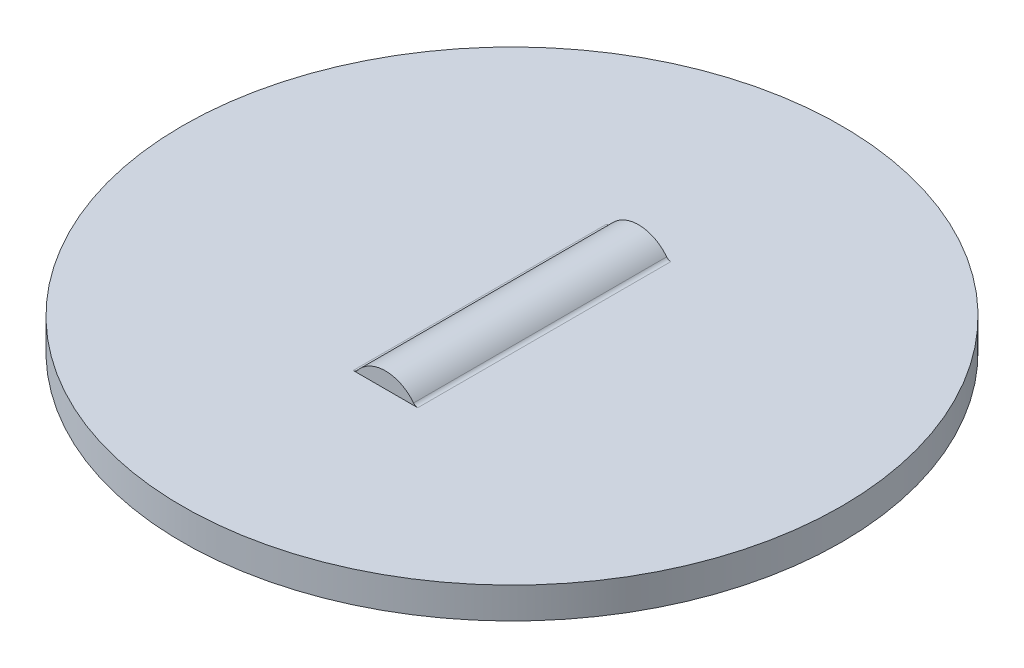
ISO-10303-21;
HEADER;
FILE_DESCRIPTION(('STEP AP214'),'2;1');
FILE_NAME('part.step','',(''),(''),'','','');
FILE_SCHEMA(('AUTOMOTIVE_DESIGN { 1 0 10303 214 1 1 1 1 }'));
ENDSEC;
DATA;
#1=APPLICATION_CONTEXT('core data for automotive mechanical design processes');
#2=APPLICATION_PROTOCOL_DEFINITION('international standard','automotive_design',2000,#1);
#3=PRODUCT_CONTEXT('',#1,'mechanical');
#4=PRODUCT('Part','Part','',(#3));
#5=PRODUCT_RELATED_PRODUCT_CATEGORY('part','',(#4));
#6=PRODUCT_DEFINITION_FORMATION('','',#4);
#7=PRODUCT_DEFINITION_CONTEXT('part definition',#1,'design');
#8=PRODUCT_DEFINITION('design','',#6,#7);
#9=PRODUCT_DEFINITION_SHAPE('','',#8);
#10=(LENGTH_UNIT() NAMED_UNIT(*) SI_UNIT(.MILLI.,.METRE.));
#11=(NAMED_UNIT(*) PLANE_ANGLE_UNIT() SI_UNIT($,.RADIAN.));
#12=(NAMED_UNIT(*) SI_UNIT($,.STERADIAN.) SOLID_ANGLE_UNIT());
#13=UNCERTAINTY_MEASURE_WITH_UNIT(LENGTH_MEASURE(1.E-05),#10,'distance_accuracy_value','');
#14=(GEOMETRIC_REPRESENTATION_CONTEXT(3) GLOBAL_UNCERTAINTY_ASSIGNED_CONTEXT((#13)) GLOBAL_UNIT_ASSIGNED_CONTEXT((#10,
#11,#12)) REPRESENTATION_CONTEXT('',''));
#15=CARTESIAN_POINT('',(0.,0.,0.));
#16=DIRECTION('',(0.,0.,1.));
#17=DIRECTION('',(1.,0.,0.));
#18=AXIS2_PLACEMENT_3D('',#15,#16,#17);
#19=CARTESIAN_POINT('',(0.,-0.9525,0.));
#20=DIRECTION('',(0.,0.,1.));
#21=DIRECTION('',(1.,0.,0.));
#22=AXIS2_PLACEMENT_3D('',#19,#20,#21);
#23=CYLINDRICAL_SURFACE('',#22,0.2159);
#24=DIRECTION('',(0.,0.,1.));
#25=VECTOR('',#24,1.);
#26=CARTESIAN_POINT('',(-0.170595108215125,-0.820174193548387,0.));
#27=LINE('',#26,#25);
#28=CARTESIAN_POINT('',(-0.170595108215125,-0.820174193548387,0.));
#29=VERTEX_POINT('',#28);
#30=CARTESIAN_POINT('',(-0.170595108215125,-0.820174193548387,12.192));
#31=VERTEX_POINT('',#30);
#32=EDGE_CURVE('E111',#29,#31,#27,.T.);
#33=ORIENTED_EDGE('',*,*,#32,.F.);
#34=CARTESIAN_POINT('',(0.,-0.9525,0.));
#35=DIRECTION('',(0.,0.,1.));
#36=DIRECTION('',(1.,0.,0.));
#37=AXIS2_PLACEMENT_3D('',#34,#35,#36);
#38=CIRCLE('',#37,0.2159);
#39=CARTESIAN_POINT('',(0.170595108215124,-0.820174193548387,0.));
#40=VERTEX_POINT('',#39);
#41=EDGE_CURVE('E114',#40,#29,#38,.T.);
#42=ORIENTED_EDGE('',*,*,#41,.F.);
#43=DIRECTION('',(0.,0.,1.));
#44=VECTOR('',#43,1.);
#45=CARTESIAN_POINT('',(0.170595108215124,-0.820174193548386,0.));
#46=LINE('',#45,#44);
#47=CARTESIAN_POINT('',(0.170595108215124,-0.820174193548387,12.192));
#48=VERTEX_POINT('',#47);
#49=EDGE_CURVE('E88',#48,#40,#46,.F.);
#50=ORIENTED_EDGE('',*,*,#49,.F.);
#51=CARTESIAN_POINT('',(0.,-0.9525,12.192));
#52=DIRECTION('',(0.,0.,1.));
#53=DIRECTION('',(1.,0.,0.));
#54=AXIS2_PLACEMENT_3D('',#51,#52,#53);
#55=CIRCLE('',#54,0.2159);
#56=EDGE_CURVE('E85',#48,#31,#55,.T.);
#57=ORIENTED_EDGE('',*,*,#56,.T.);
#58=EDGE_LOOP('',(#33,#42,#50,#57));
#59=FACE_BOUND('',#58,.T.);
#60=ADVANCED_FACE('F18',(#59),#23,.F.);
#61=CARTESIAN_POINT('',(1.55542598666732,0.254,0.));
#62=DIRECTION('',(0.,0.,1.));
#63=DIRECTION('',(1.,0.,0.));
#64=AXIS2_PLACEMENT_3D('',#61,#62,#63);
#65=CYLINDRICAL_SURFACE('',#64,1.7526);
#66=CARTESIAN_POINT('',(1.55542598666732,0.254,0.));
#67=DIRECTION('',(0.,0.,1.));
#68=DIRECTION('',(1.,0.,0.));
#69=AXIS2_PLACEMENT_3D('',#66,#67,#68);
#70=CIRCLE('',#69,1.7526);
#71=CARTESIAN_POINT('',(1.55542598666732,-1.4986,0.));
#72=VERTEX_POINT('',#71);
#73=EDGE_CURVE('E101',#72,#40,#70,.F.);
#74=ORIENTED_EDGE('',*,*,#73,.F.);
#75=DIRECTION('',(0.,0.,1.));
#76=VECTOR('',#75,1.);
#77=CARTESIAN_POINT('',(1.55542598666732,-1.4986,12.192));
#78=LINE('',#77,#76);
#79=CARTESIAN_POINT('',(1.55542598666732,-1.4986,12.192));
#80=VERTEX_POINT('',#79);
#81=EDGE_CURVE('E94',#72,#80,#78,.T.);
#82=ORIENTED_EDGE('',*,*,#81,.T.);
#83=CARTESIAN_POINT('',(1.55542598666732,0.254,12.192));
#84=DIRECTION('',(0.,0.,1.));
#85=DIRECTION('',(1.,0.,0.));
#86=AXIS2_PLACEMENT_3D('',#83,#84,#85);
#87=CIRCLE('',#86,1.7526);
#88=EDGE_CURVE('E21',#80,#48,#87,.F.);
#89=ORIENTED_EDGE('',*,*,#88,.T.);
#90=ORIENTED_EDGE('',*,*,#49,.T.);
#91=EDGE_LOOP('',(#74,#82,#89,#90));
#92=FACE_BOUND('',#91,.T.);
#93=ADVANCED_FACE('F99',(#92),#65,.T.);
#94=CARTESIAN_POINT('',(0.,-0.9525,12.192));
#95=DIRECTION('',(0.,0.,1.));
#96=DIRECTION('',(1.,0.,0.));
#97=AXIS2_PLACEMENT_3D('',#94,#95,#96);
#98=PLANE('',#97);
#99=ORIENTED_EDGE('',*,*,#88,.F.);
#100=DIRECTION('',(1.,0.,0.));
#101=VECTOR('',#100,1.);
#102=CARTESIAN_POINT('',(-15.875,-1.4986,12.192));
#103=LINE('',#102,#101);
#104=CARTESIAN_POINT('',(-1.55542598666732,-1.4986,12.192));
#105=VERTEX_POINT('',#104);
#106=EDGE_CURVE('E84',#80,#105,#103,.F.);
#107=ORIENTED_EDGE('',*,*,#106,.T.);
#108=CARTESIAN_POINT('',(-1.55542598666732,0.254,12.192));
#109=DIRECTION('',(0.,0.,1.));
#110=DIRECTION('',(1.,0.,0.));
#111=AXIS2_PLACEMENT_3D('',#108,#109,#110);
#112=CIRCLE('',#111,1.7526);
#113=EDGE_CURVE('E115',#31,#105,#112,.F.);
#114=ORIENTED_EDGE('',*,*,#113,.F.);
#115=ORIENTED_EDGE('',*,*,#56,.F.);
#116=EDGE_LOOP('',(#99,#107,#114,#115));
#117=FACE_BOUND('',#116,.T.);
#118=ADVANCED_FACE('F82',(#117),#98,.F.);
#119=CARTESIAN_POINT('',(-1.55542598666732,0.254,0.));
#120=DIRECTION('',(0.,0.,1.));
#121=DIRECTION('',(1.,0.,0.));
#122=AXIS2_PLACEMENT_3D('',#119,#120,#121);
#123=CYLINDRICAL_SURFACE('',#122,1.7526);
#124=CARTESIAN_POINT('',(-1.55542598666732,0.254,0.));
#125=DIRECTION('',(0.,0.,1.));
#126=DIRECTION('',(1.,0.,0.));
#127=AXIS2_PLACEMENT_3D('',#124,#125,#126);
#128=CIRCLE('',#127,1.7526);
#129=CARTESIAN_POINT('',(-1.55542598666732,-1.4986,0.));
#130=VERTEX_POINT('',#129);
#131=EDGE_CURVE('E104',#29,#130,#128,.F.);
#132=ORIENTED_EDGE('',*,*,#131,.F.);
#133=ORIENTED_EDGE('',*,*,#32,.T.);
#134=ORIENTED_EDGE('',*,*,#113,.T.);
#135=DIRECTION('',(0.,0.,1.));
#136=VECTOR('',#135,1.);
#137=CARTESIAN_POINT('',(-1.55542598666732,-1.4986,12.192));
#138=LINE('',#137,#136);
#139=EDGE_CURVE('E97',#105,#130,#138,.F.);
#140=ORIENTED_EDGE('',*,*,#139,.T.);
#141=EDGE_LOOP('',(#132,#133,#134,#140));
#142=FACE_BOUND('',#141,.T.);
#143=ADVANCED_FACE('F147',(#142),#123,.T.);
#144=CARTESIAN_POINT('',(0.,-0.9525,0.));
#145=DIRECTION('',(0.,0.,1.));
#146=DIRECTION('',(1.,0.,0.));
#147=AXIS2_PLACEMENT_3D('',#144,#145,#146);
#148=PLANE('',#147);
#149=DIRECTION('',(1.,0.,0.));
#150=VECTOR('',#149,1.);
#151=CARTESIAN_POINT('',(-15.875,-1.4986,0.));
#152=LINE('',#151,#150);
#153=EDGE_CURVE('E107',#130,#72,#152,.T.);
#154=ORIENTED_EDGE('',*,*,#153,.T.);
#155=ORIENTED_EDGE('',*,*,#73,.T.);
#156=ORIENTED_EDGE('',*,*,#41,.T.);
#157=ORIENTED_EDGE('',*,*,#131,.T.);
#158=EDGE_LOOP('',(#154,#155,#156,#157));
#159=FACE_BOUND('',#158,.T.);
#160=ADVANCED_FACE('F149',(#159),#148,.T.);
#161=CARTESIAN_POINT('',(-15.875,-1.4986,12.192));
#162=DIRECTION('',(0.,1.,0.));
#163=DIRECTION('',(0.,0.,1.));
#164=AXIS2_PLACEMENT_3D('',#161,#162,#163);
#165=PLANE('',#164);
#166=ORIENTED_EDGE('',*,*,#139,.F.);
#167=ORIENTED_EDGE('',*,*,#106,.F.);
#168=ORIENTED_EDGE('',*,*,#81,.F.);
#169=ORIENTED_EDGE('',*,*,#153,.F.);
#170=EDGE_LOOP('',(#166,#167,#168,#169));
#171=FACE_BOUND('',#170,.T.);
#172=CARTESIAN_POINT('',(0.,-1.4986,6.096));
#173=DIRECTION('',(0.,-1.,0.));
#174=DIRECTION('',(1.,0.,0.));
#175=AXIS2_PLACEMENT_3D('',#172,#173,#174);
#176=CIRCLE('',#175,15.875);
#177=CARTESIAN_POINT('',(15.875,-1.4986,6.096));
#178=VERTEX_POINT('',#177);
#179=EDGE_CURVE('E136',#178,#178,#176,.F.);
#180=ORIENTED_EDGE('',*,*,#179,.F.);
#181=EDGE_LOOP('',(#180));
#182=FACE_BOUND('',#181,.T.);
#183=ADVANCED_FACE('F91',(#171,#182),#165,.F.);
#184=CARTESIAN_POINT('',(0.,-0.9525,12.192));
#185=DIRECTION('',(0.,0.,-1.));
#186=DIRECTION('',(-1.,0.,0.));
#187=AXIS2_PLACEMENT_3D('',#184,#185,#186);
#188=CYLINDRICAL_SURFACE('',#187,1.7145);
#189=CARTESIAN_POINT('',(0.,-0.9525,0.));
#190=DIRECTION('',(0.,0.,-1.));
#191=DIRECTION('',(-1.,0.,0.));
#192=AXIS2_PLACEMENT_3D('',#189,#190,#191);
#193=CIRCLE('',#192,1.7145);
#194=CARTESIAN_POINT('',(-1.35472585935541,0.0983225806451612,0.));
#195=VERTEX_POINT('',#194);
#196=CARTESIAN_POINT('',(1.35472585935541,0.0983225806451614,0.));
#197=VERTEX_POINT('',#196);
#198=EDGE_CURVE('E134',#195,#197,#193,.T.);
#199=ORIENTED_EDGE('',*,*,#198,.F.);
#200=DIRECTION('',(0.,0.,-1.));
#201=VECTOR('',#200,1.);
#202=CARTESIAN_POINT('',(-1.35472585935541,0.0983225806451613,12.192));
#203=LINE('',#202,#201);
#204=CARTESIAN_POINT('',(-1.35472585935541,0.0983225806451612,12.192));
#205=VERTEX_POINT('',#204);
#206=EDGE_CURVE('E130',#195,#205,#203,.F.);
#207=ORIENTED_EDGE('',*,*,#206,.T.);
#208=CARTESIAN_POINT('',(0.,-0.9525,12.192));
#209=DIRECTION('',(0.,0.,-1.));
#210=DIRECTION('',(-1.,0.,0.));
#211=AXIS2_PLACEMENT_3D('',#208,#209,#210);
#212=CIRCLE('',#211,1.7145);
#213=CARTESIAN_POINT('',(1.35472585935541,0.0983225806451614,12.192));
#214=VERTEX_POINT('',#213);
#215=EDGE_CURVE('E125',#205,#214,#212,.T.);
#216=ORIENTED_EDGE('',*,*,#215,.T.);
#217=DIRECTION('',(0.,0.,-1.));
#218=VECTOR('',#217,1.);
#219=CARTESIAN_POINT('',(1.35472585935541,0.0983225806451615,12.192));
#220=LINE('',#219,#218);
#221=EDGE_CURVE('E120',#214,#197,#220,.T.);
#222=ORIENTED_EDGE('',*,*,#221,.T.);
#223=EDGE_LOOP('',(#199,#207,#216,#222));
#224=FACE_BOUND('',#223,.T.);
#225=ADVANCED_FACE('F176',(#224),#188,.T.);
#226=CARTESIAN_POINT('',(0.,0.,6.096));
#227=DIRECTION('',(0.,-1.,0.));
#228=DIRECTION('',(1.,0.,0.));
#229=AXIS2_PLACEMENT_3D('',#226,#227,#228);
#230=CYLINDRICAL_SURFACE('',#229,15.875);
#231=ORIENTED_EDGE('',*,*,#179,.T.);
#232=EDGE_LOOP('',(#231));
#233=FACE_BOUND('',#232,.T.);
#234=CARTESIAN_POINT('',(0.,0.,6.096));
#235=DIRECTION('',(0.,-1.,0.));
#236=DIRECTION('',(1.,0.,0.));
#237=AXIS2_PLACEMENT_3D('',#234,#235,#236);
#238=CIRCLE('',#237,15.875);
#239=CARTESIAN_POINT('',(15.875,0.,6.096));
#240=VERTEX_POINT('',#239);
#241=EDGE_CURVE('E116',#240,#240,#238,.T.);
#242=ORIENTED_EDGE('',*,*,#241,.T.);
#243=EDGE_LOOP('',(#242));
#244=FACE_BOUND('',#243,.T.);
#245=ADVANCED_FACE('F178',(#233,#244),#230,.T.);
#246=CARTESIAN_POINT('',(-1.55542598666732,0.254,0.));
#247=DIRECTION('',(0.,0.,-1.));
#248=DIRECTION('',(-1.,0.,0.));
#249=AXIS2_PLACEMENT_3D('',#246,#247,#248);
#250=PLANE('',#249);
#251=CARTESIAN_POINT('',(-1.55542598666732,0.254,0.));
#252=DIRECTION('',(0.,0.,-1.));
#253=DIRECTION('',(-1.,0.,0.));
#254=AXIS2_PLACEMENT_3D('',#251,#252,#253);
#255=CIRCLE('',#254,0.254);
#256=CARTESIAN_POINT('',(-1.55542598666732,0.,0.));
#257=VERTEX_POINT('',#256);
#258=EDGE_CURVE('E131',#257,#195,#255,.F.);
#259=ORIENTED_EDGE('',*,*,#258,.T.);
#260=ORIENTED_EDGE('',*,*,#198,.T.);
#261=CARTESIAN_POINT('',(1.55542598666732,0.254,0.));
#262=DIRECTION('',(0.,0.,-1.));
#263=DIRECTION('',(-1.,0.,0.));
#264=AXIS2_PLACEMENT_3D('',#261,#262,#263);
#265=CIRCLE('',#264,0.254);
#266=CARTESIAN_POINT('',(1.55542598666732,0.,0.));
#267=VERTEX_POINT('',#266);
#268=EDGE_CURVE('E122',#197,#267,#265,.F.);
#269=ORIENTED_EDGE('',*,*,#268,.T.);
#270=DIRECTION('',(1.,0.,0.));
#271=VECTOR('',#270,1.);
#272=CARTESIAN_POINT('',(1.55542598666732,0.,0.));
#273=LINE('',#272,#271);
#274=EDGE_CURVE('E119',#267,#257,#273,.F.);
#275=ORIENTED_EDGE('',*,*,#274,.T.);
#276=EDGE_LOOP('',(#259,#260,#269,#275));
#277=FACE_BOUND('',#276,.T.);
#278=ADVANCED_FACE('F169',(#277),#250,.T.);
#279=CARTESIAN_POINT('',(-1.55542598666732,0.254,12.192));
#280=DIRECTION('',(0.,0.,-1.));
#281=DIRECTION('',(-1.,0.,0.));
#282=AXIS2_PLACEMENT_3D('',#279,#280,#281);
#283=CYLINDRICAL_SURFACE('',#282,0.254);
#284=CARTESIAN_POINT('',(-1.55542598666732,0.254,12.192));
#285=DIRECTION('',(0.,0.,-1.));
#286=DIRECTION('',(-1.,0.,0.));
#287=AXIS2_PLACEMENT_3D('',#284,#285,#286);
#288=CIRCLE('',#287,0.254);
#289=CARTESIAN_POINT('',(-1.55542598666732,0.,12.192));
#290=VERTEX_POINT('',#289);
#291=EDGE_CURVE('E127',#290,#205,#288,.F.);
#292=ORIENTED_EDGE('',*,*,#291,.T.);
#293=ORIENTED_EDGE('',*,*,#206,.F.);
#294=ORIENTED_EDGE('',*,*,#258,.F.);
#295=DIRECTION('',(0.,0.,1.));
#296=VECTOR('',#295,1.);
#297=CARTESIAN_POINT('',(-1.55542598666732,0.,12.192));
#298=LINE('',#297,#296);
#299=EDGE_CURVE('E155',#257,#290,#298,.T.);
#300=ORIENTED_EDGE('',*,*,#299,.T.);
#301=EDGE_LOOP('',(#292,#293,#294,#300));
#302=FACE_BOUND('',#301,.T.);
#303=ADVANCED_FACE('F162',(#302),#283,.F.);
#304=CARTESIAN_POINT('',(-1.55542598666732,0.254,12.192));
#305=DIRECTION('',(0.,0.,-1.));
#306=DIRECTION('',(-1.,0.,0.));
#307=AXIS2_PLACEMENT_3D('',#304,#305,#306);
#308=PLANE('',#307);
#309=CARTESIAN_POINT('',(1.55542598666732,0.254,12.192));
#310=DIRECTION('',(0.,0.,-1.));
#311=DIRECTION('',(-1.,0.,0.));
#312=AXIS2_PLACEMENT_3D('',#309,#310,#311);
#313=CIRCLE('',#312,0.254);
#314=CARTESIAN_POINT('',(1.55542598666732,0.,12.192));
#315=VERTEX_POINT('',#314);
#316=EDGE_CURVE('E35',#315,#214,#313,.T.);
#317=ORIENTED_EDGE('',*,*,#316,.T.);
#318=ORIENTED_EDGE('',*,*,#215,.F.);
#319=ORIENTED_EDGE('',*,*,#291,.F.);
#320=DIRECTION('',(1.,0.,0.));
#321=VECTOR('',#320,1.);
#322=CARTESIAN_POINT('',(1.55542598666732,0.,12.192));
#323=LINE('',#322,#321);
#324=EDGE_CURVE('E27',#290,#315,#323,.T.);
#325=ORIENTED_EDGE('',*,*,#324,.T.);
#326=EDGE_LOOP('',(#317,#318,#319,#325));
#327=FACE_BOUND('',#326,.T.);
#328=ADVANCED_FACE('F173',(#327),#308,.F.);
#329=CARTESIAN_POINT('',(1.55542598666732,0.254,12.192));
#330=DIRECTION('',(0.,0.,-1.));
#331=DIRECTION('',(-1.,0.,0.));
#332=AXIS2_PLACEMENT_3D('',#329,#330,#331);
#333=CYLINDRICAL_SURFACE('',#332,0.254);
#334=ORIENTED_EDGE('',*,*,#316,.F.);
#335=DIRECTION('',(0.,0.,1.));
#336=VECTOR('',#335,1.);
#337=CARTESIAN_POINT('',(1.55542598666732,0.,12.192));
#338=LINE('',#337,#336);
#339=EDGE_CURVE('E11',#315,#267,#338,.F.);
#340=ORIENTED_EDGE('',*,*,#339,.T.);
#341=ORIENTED_EDGE('',*,*,#268,.F.);
#342=ORIENTED_EDGE('',*,*,#221,.F.);
#343=EDGE_LOOP('',(#334,#340,#341,#342));
#344=FACE_BOUND('',#343,.T.);
#345=ADVANCED_FACE('F171',(#344),#333,.F.);
#346=CARTESIAN_POINT('',(1.55542598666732,0.,12.192));
#347=DIRECTION('',(0.,-1.,0.));
#348=DIRECTION('',(1.,0.,0.));
#349=AXIS2_PLACEMENT_3D('',#346,#347,#348);
#350=PLANE('',#349);
#351=ORIENTED_EDGE('',*,*,#324,.F.);
#352=ORIENTED_EDGE('',*,*,#299,.F.);
#353=ORIENTED_EDGE('',*,*,#274,.F.);
#354=ORIENTED_EDGE('',*,*,#339,.F.);
#355=EDGE_LOOP('',(#351,#352,#353,#354));
#356=FACE_BOUND('',#355,.T.);
#357=ORIENTED_EDGE('',*,*,#241,.F.);
#358=EDGE_LOOP('',(#357));
#359=FACE_BOUND('',#358,.T.);
#360=ADVANCED_FACE('F166',(#356,#359),#350,.F.);
#361=CLOSED_SHELL('',(#60,#93,#118,#143,#160,#183,#225,#245,#278,#303,#328,#345,#360));
#362=MANIFOLD_SOLID_BREP('B1',#361);
#363=ADVANCED_BREP_SHAPE_REPRESENTATION('',(#18,#362),#14);
#364=SHAPE_DEFINITION_REPRESENTATION(#9,#363);
ENDSEC;
END-ISO-10303-21;
